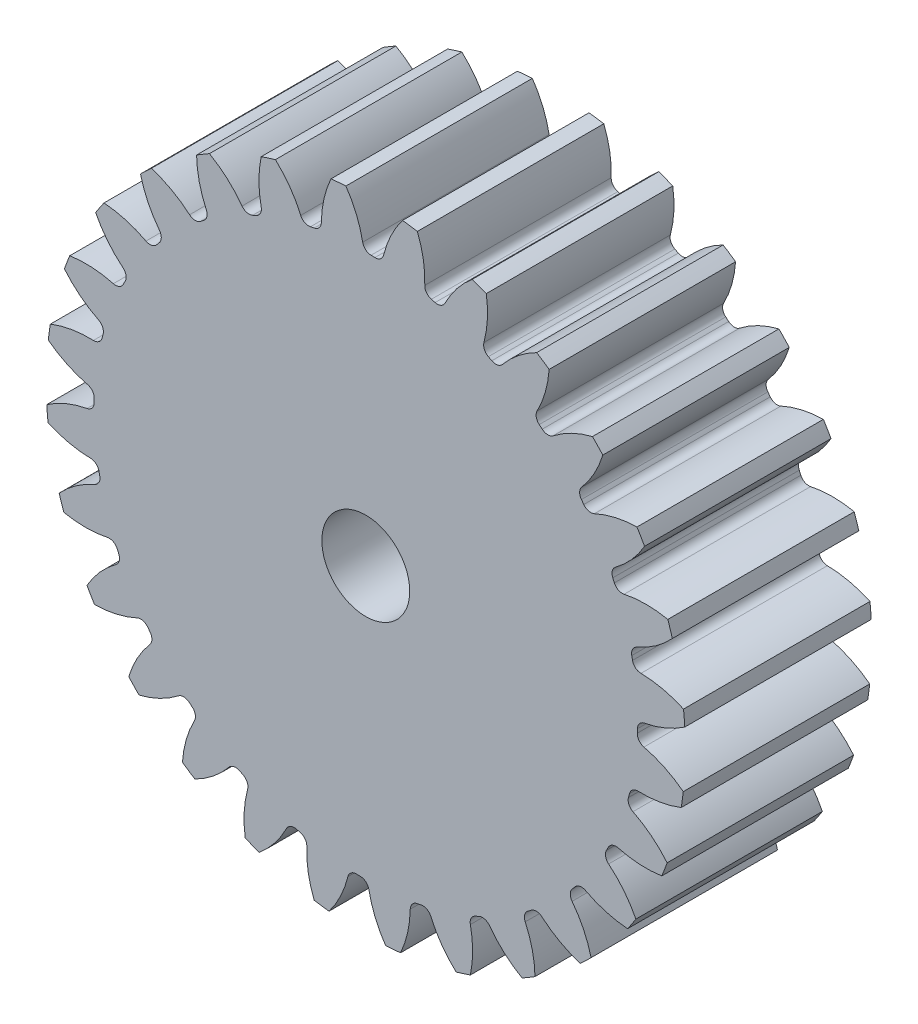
from build123d import *

# Parameters (mm, degrees)
SKETCH3_R         = 152.4
GEARBODY_DEPTH    = 88.9
TOOTHCUT_DEPTH    = 234.141008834
CIRPATTERN1_COUNT = 28
BOREDIA_R         = 20.955
BORE_DEPTH        = 12700


with BuildPart() as part:
    # Sketch3 → gearBody (new body)
    with BuildSketch(Plane.XY):
        Circle(SKETCH3_R)
    extrude(amount=GEARBODY_DEPTH)

    # Sketch2 → toothCut (cut, through all)
    with BuildSketch(Plane.XY):
        with BuildLine():
            ThreePointArc((129.466251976, -4.370491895), (129.494323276, -3.439744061), (129.51570341, -2.508818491))
            ThreePointArc((129.51570341, -2.508818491), (130.491683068, 0.080168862), (132.881675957, 1.474201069))
            ThreePointArc((132.881675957, 1.474201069), (143.075048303, 4.542445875), (152.4, 9.677058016))
            ThreePointArc((152.4, 9.677058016), (152.65308112, -4.054907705), (151.671349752, -17.754073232))
            ThreePointArc((151.671349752, -17.754073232), (142.632135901, -12.131655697), (132.616026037, -8.526588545))
            ThreePointArc((132.616026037, -8.526588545), (130.30341031, -7.007641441), (129.466251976, -4.370491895))
        make_face()
    toothcut = extrude(amount=TOOTHCUT_DEPTH, mode=Mode.SUBTRACT)

    # CirPattern1: toothCut ×28 about axis
    cirpattern1_axis = Axis((0, 0, 0), (0, 0, 1))
    for i in range(1, CIRPATTERN1_COUNT):
        add(toothcut.rotate(cirpattern1_axis, i * 360 / CIRPATTERN1_COUNT), mode=Mode.SUBTRACT)

    # boreDia → bore (cut, symmetric)
    with BuildSketch(Plane.XY):
        Circle(BOREDIA_R)
    extrude(amount=BORE_DEPTH, both=True, mode=Mode.SUBTRACT)


solid = part.part
